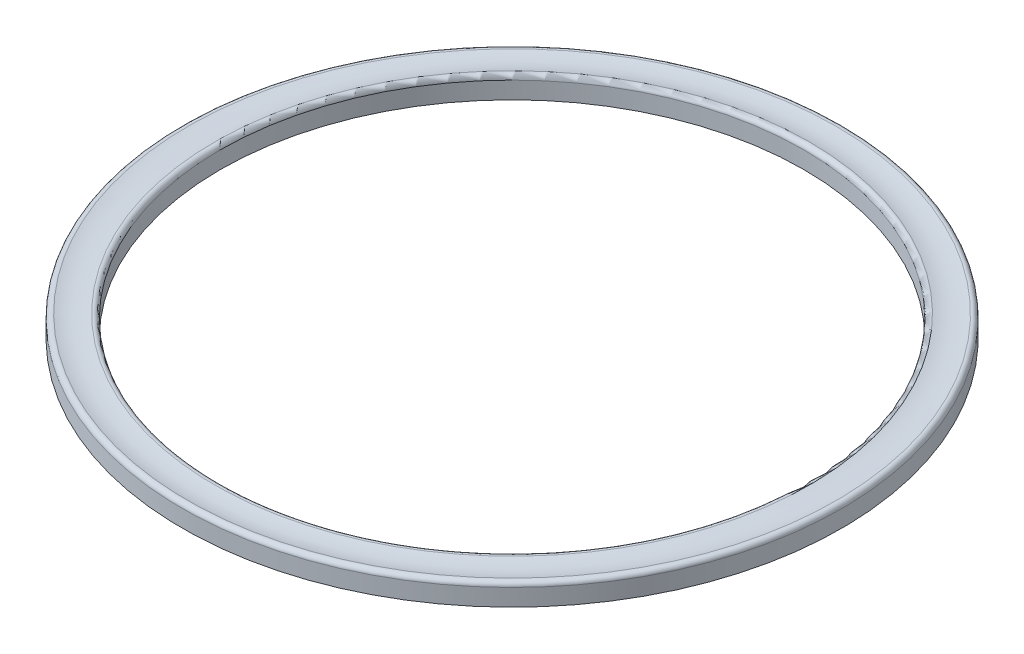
ISO-10303-21;
HEADER;
FILE_DESCRIPTION(('STEP AP214'),'2;1');
FILE_NAME('part.step','',(''),(''),'','','');
FILE_SCHEMA(('AUTOMOTIVE_DESIGN { 1 0 10303 214 1 1 1 1 }'));
ENDSEC;
DATA;
#1=APPLICATION_CONTEXT('core data for automotive mechanical design processes');
#2=APPLICATION_PROTOCOL_DEFINITION('international standard','automotive_design',2000,#1);
#3=PRODUCT_CONTEXT('',#1,'mechanical');
#4=PRODUCT('Part','Part','',(#3));
#5=PRODUCT_RELATED_PRODUCT_CATEGORY('part','',(#4));
#6=PRODUCT_DEFINITION_FORMATION('','',#4);
#7=PRODUCT_DEFINITION_CONTEXT('part definition',#1,'design');
#8=PRODUCT_DEFINITION('design','',#6,#7);
#9=PRODUCT_DEFINITION_SHAPE('','',#8);
#10=(LENGTH_UNIT() NAMED_UNIT(*) SI_UNIT(.MILLI.,.METRE.));
#11=(NAMED_UNIT(*) PLANE_ANGLE_UNIT() SI_UNIT($,.RADIAN.));
#12=(NAMED_UNIT(*) SI_UNIT($,.STERADIAN.) SOLID_ANGLE_UNIT());
#13=UNCERTAINTY_MEASURE_WITH_UNIT(LENGTH_MEASURE(1.E-05),#10,'distance_accuracy_value','');
#14=(GEOMETRIC_REPRESENTATION_CONTEXT(3) GLOBAL_UNCERTAINTY_ASSIGNED_CONTEXT((#13)) GLOBAL_UNIT_ASSIGNED_CONTEXT((#10,
#11,#12)) REPRESENTATION_CONTEXT('',''));
#15=CARTESIAN_POINT('',(0.,0.,0.));
#16=DIRECTION('',(0.,0.,1.));
#17=DIRECTION('',(1.,0.,0.));
#18=AXIS2_PLACEMENT_3D('',#15,#16,#17);
#19=CARTESIAN_POINT('',(19.0881,0.,0.));
#20=DIRECTION('',(0.,-1.,0.));
#21=DIRECTION('',(0.,0.,-1.));
#22=AXIS2_PLACEMENT_3D('',#19,#20,#21);
#23=PLANE('',#22);
#24=CARTESIAN_POINT('',(0.,0.,0.));
#25=DIRECTION('',(0.,-1.,0.));
#26=DIRECTION('',(0.,0.,-1.));
#27=AXIS2_PLACEMENT_3D('',#24,#25,#26);
#28=CIRCLE('',#27,19.0881);
#29=CARTESIAN_POINT('',(0.,0.,-19.0881));
#30=VERTEX_POINT('',#29);
#31=EDGE_CURVE('E10',#30,#30,#28,.T.);
#32=ORIENTED_EDGE('',*,*,#31,.T.);
#33=EDGE_LOOP('',(#32));
#34=FACE_BOUND('',#33,.T.);
#35=CARTESIAN_POINT('',(0.,0.,0.));
#36=DIRECTION('',(0.,-1.,0.));
#37=DIRECTION('',(0.,0.,-1.));
#38=AXIS2_PLACEMENT_3D('',#35,#36,#37);
#39=CIRCLE('',#38,16.9037);
#40=CARTESIAN_POINT('',(0.,0.,-16.9037));
#41=VERTEX_POINT('',#40);
#42=EDGE_CURVE('E48',#41,#41,#39,.T.);
#43=ORIENTED_EDGE('',*,*,#42,.F.);
#44=EDGE_LOOP('',(#43));
#45=FACE_BOUND('',#44,.T.);
#46=ADVANCED_FACE('F26',(#34,#45),#23,.T.);
#47=CARTESIAN_POINT('',(0.,0.,0.));
#48=DIRECTION('',(0.,-1.,0.));
#49=DIRECTION('',(0.,0.,-1.));
#50=AXIS2_PLACEMENT_3D('',#47,#48,#49);
#51=CYLINDRICAL_SURFACE('',#50,19.0881);
#52=CARTESIAN_POINT('',(0.,0.989941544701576,0.));
#53=DIRECTION('',(0.,-1.,0.));
#54=DIRECTION('',(0.,0.,-1.));
#55=AXIS2_PLACEMENT_3D('',#52,#53,#54);
#56=CIRCLE('',#55,19.0881);
#57=CARTESIAN_POINT('',(0.,0.989941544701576,-19.0881));
#58=VERTEX_POINT('',#57);
#59=EDGE_CURVE('E32',#58,#58,#56,.T.);
#60=ORIENTED_EDGE('',*,*,#59,.T.);
#61=EDGE_LOOP('',(#60));
#62=FACE_BOUND('',#61,.T.);
#63=ORIENTED_EDGE('',*,*,#31,.F.);
#64=EDGE_LOOP('',(#63));
#65=FACE_BOUND('',#64,.T.);
#66=ADVANCED_FACE('F56',(#62,#65),#51,.T.);
#67=CARTESIAN_POINT('',(0.,0.989941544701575,0.));
#68=DIRECTION('',(0.,-1.,0.));
#69=DIRECTION('',(0.,0.,-1.));
#70=AXIS2_PLACEMENT_3D('',#67,#68,#69);
#71=TOROIDAL_SURFACE('',#70,18.8341,0.254000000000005);
#72=CARTESIAN_POINT('',(0.,1.23667956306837,0.));
#73=DIRECTION('',(0.,-1.,0.));
#74=DIRECTION('',(0.,0.,-1.));
#75=AXIS2_PLACEMENT_3D('',#72,#73,#74);
#76=CIRCLE('',#75,18.7737978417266);
#77=CARTESIAN_POINT('',(0.,1.23667956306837,-18.7737978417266));
#78=VERTEX_POINT('',#77);
#79=EDGE_CURVE('E36',#78,#78,#76,.T.);
#80=ORIENTED_EDGE('',*,*,#79,.T.);
#81=EDGE_LOOP('',(#80));
#82=FACE_BOUND('',#81,.T.);
#83=ORIENTED_EDGE('',*,*,#59,.F.);
#84=EDGE_LOOP('',(#83));
#85=FACE_BOUND('',#84,.T.);
#86=ADVANCED_FACE('F60',(#82,#85),#71,.T.);
#87=CARTESIAN_POINT('',(0.,4.4196,0.));
#88=DIRECTION('',(0.,-1.,0.));
#89=DIRECTION('',(0.,0.,-1.));
#90=AXIS2_PLACEMENT_3D('',#87,#88,#89);
#91=TOROIDAL_SURFACE('',#90,17.9959,3.2766);
#92=CARTESIAN_POINT('',(0.,1.23667956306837,0.));
#93=DIRECTION('',(0.,-1.,0.));
#94=DIRECTION('',(0.,0.,-1.));
#95=AXIS2_PLACEMENT_3D('',#92,#93,#94);
#96=CIRCLE('',#95,17.2180021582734);
#97=CARTESIAN_POINT('',(0.,1.23667956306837,-17.2180021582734));
#98=VERTEX_POINT('',#97);
#99=EDGE_CURVE('E40',#98,#98,#96,.T.);
#100=ORIENTED_EDGE('',*,*,#99,.T.);
#101=EDGE_LOOP('',(#100));
#102=FACE_BOUND('',#101,.T.);
#103=ORIENTED_EDGE('',*,*,#79,.F.);
#104=EDGE_LOOP('',(#103));
#105=FACE_BOUND('',#104,.T.);
#106=ADVANCED_FACE('F64',(#102,#105),#91,.F.);
#107=CARTESIAN_POINT('',(0.,0.989941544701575,0.));
#108=DIRECTION('',(0.,-1.,0.));
#109=DIRECTION('',(0.,0.,-1.));
#110=AXIS2_PLACEMENT_3D('',#107,#108,#109);
#111=TOROIDAL_SURFACE('',#110,17.1577,0.254000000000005);
#112=CARTESIAN_POINT('',(0.,0.989941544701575,0.));
#113=DIRECTION('',(0.,-1.,0.));
#114=DIRECTION('',(0.,0.,-1.));
#115=AXIS2_PLACEMENT_3D('',#112,#113,#114);
#116=CIRCLE('',#115,16.9037);
#117=CARTESIAN_POINT('',(0.,0.989941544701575,-16.9037));
#118=VERTEX_POINT('',#117);
#119=EDGE_CURVE('E45',#118,#118,#116,.T.);
#120=ORIENTED_EDGE('',*,*,#119,.T.);
#121=EDGE_LOOP('',(#120));
#122=FACE_BOUND('',#121,.T.);
#123=ORIENTED_EDGE('',*,*,#99,.F.);
#124=EDGE_LOOP('',(#123));
#125=FACE_BOUND('',#124,.T.);
#126=ADVANCED_FACE('F71',(#122,#125),#111,.T.);
#127=CARTESIAN_POINT('',(0.,0.,0.));
#128=DIRECTION('',(0.,-1.,0.));
#129=DIRECTION('',(0.,0.,-1.));
#130=AXIS2_PLACEMENT_3D('',#127,#128,#129);
#131=CYLINDRICAL_SURFACE('',#130,16.9037);
#132=ORIENTED_EDGE('',*,*,#42,.T.);
#133=EDGE_LOOP('',(#132));
#134=FACE_BOUND('',#133,.T.);
#135=ORIENTED_EDGE('',*,*,#119,.F.);
#136=EDGE_LOOP('',(#135));
#137=FACE_BOUND('',#136,.T.);
#138=ADVANCED_FACE('F52',(#134,#137),#131,.F.);
#139=CLOSED_SHELL('',(#46,#66,#86,#106,#126,#138));
#140=MANIFOLD_SOLID_BREP('B2',#139);
#141=ADVANCED_BREP_SHAPE_REPRESENTATION('',(#18,#140),#14);
#142=SHAPE_DEFINITION_REPRESENTATION(#9,#141);
ENDSEC;
END-ISO-10303-21;
